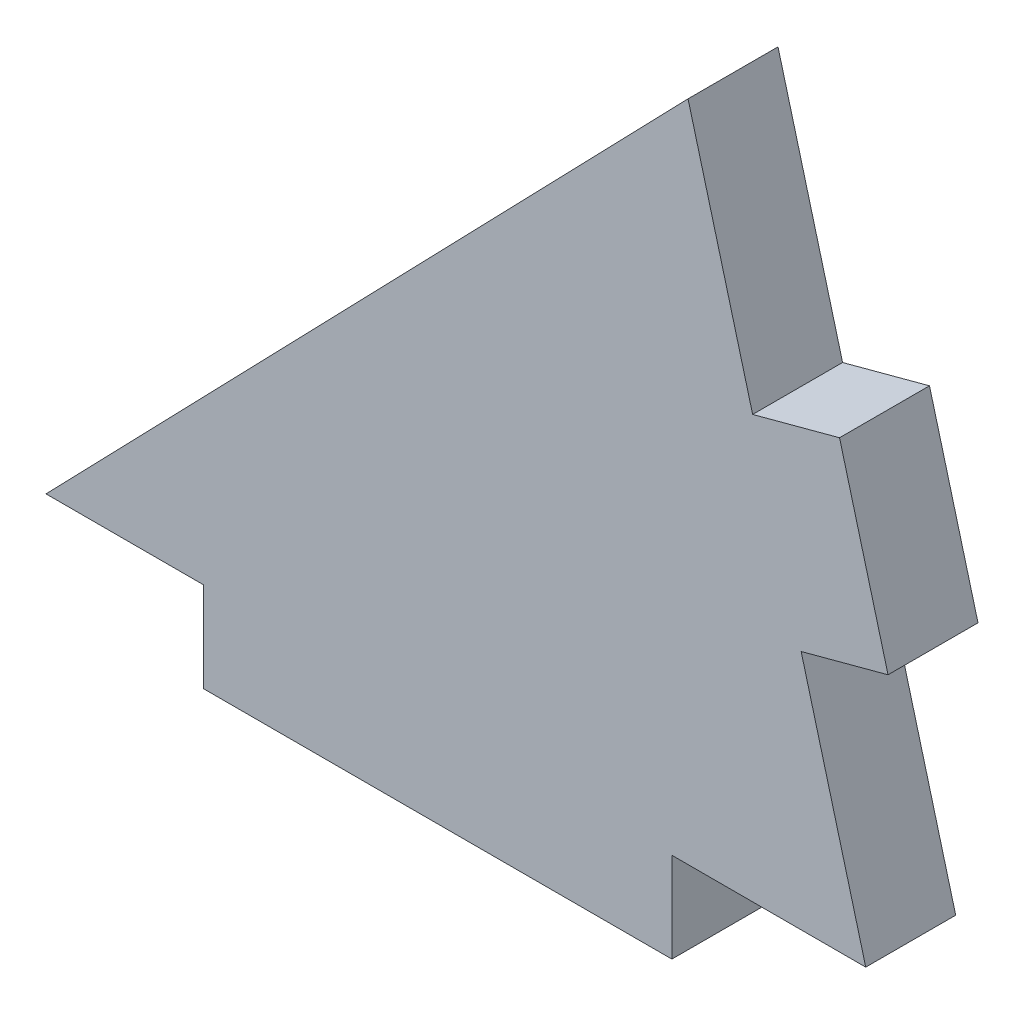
from build123d import *

# Parameters (mm, degrees)
BOSS_EXTRUDE1_DEPTH = 1.524


with BuildPart() as part:
    # Sketch1 → Boss-Extrude1 (new body)
    with BuildSketch(Plane.XY):
        Polygon((18.228516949, 0), (18.228516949, -1.524), (26.166016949, -1.524), (26.166016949, 0), (29.450089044, 0), (28.355780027, 4.084016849), (29.827850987, 4.478457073), (29.006100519, 7.545271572), (27.534029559, 7.150831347), (26.439720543, 11.234848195), (15.563150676, 0), align=None)
    extrude(amount=BOSS_EXTRUDE1_DEPTH)


solid = part.part
